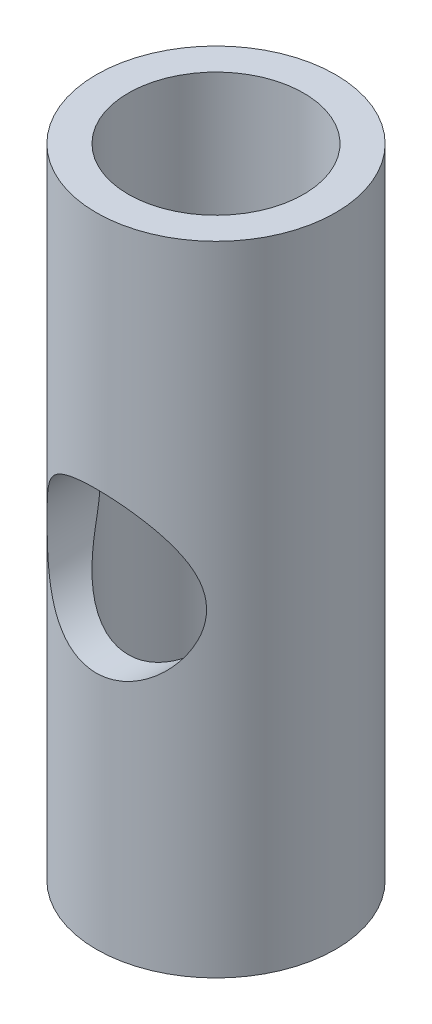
ISO-10303-21;
HEADER;
FILE_DESCRIPTION(('STEP AP214'),'2;1');
FILE_NAME('part.step','',(''),(''),'','','');
FILE_SCHEMA(('AUTOMOTIVE_DESIGN { 1 0 10303 214 1 1 1 1 }'));
ENDSEC;
DATA;
#1=APPLICATION_CONTEXT('core data for automotive mechanical design processes');
#2=APPLICATION_PROTOCOL_DEFINITION('international standard','automotive_design',2000,#1);
#3=PRODUCT_CONTEXT('',#1,'mechanical');
#4=PRODUCT('Part','Part','',(#3));
#5=PRODUCT_RELATED_PRODUCT_CATEGORY('part','',(#4));
#6=PRODUCT_DEFINITION_FORMATION('','',#4);
#7=PRODUCT_DEFINITION_CONTEXT('part definition',#1,'design');
#8=PRODUCT_DEFINITION('design','',#6,#7);
#9=PRODUCT_DEFINITION_SHAPE('','',#8);
#10=(LENGTH_UNIT() NAMED_UNIT(*) SI_UNIT(.MILLI.,.METRE.));
#11=(NAMED_UNIT(*) PLANE_ANGLE_UNIT() SI_UNIT($,.RADIAN.));
#12=(NAMED_UNIT(*) SI_UNIT($,.STERADIAN.) SOLID_ANGLE_UNIT());
#13=UNCERTAINTY_MEASURE_WITH_UNIT(LENGTH_MEASURE(1.E-05),#10,'distance_accuracy_value','');
#14=(GEOMETRIC_REPRESENTATION_CONTEXT(3) GLOBAL_UNCERTAINTY_ASSIGNED_CONTEXT((#13)) GLOBAL_UNIT_ASSIGNED_CONTEXT((#10,
#11,#12)) REPRESENTATION_CONTEXT('',''));
#15=CARTESIAN_POINT('',(0.,0.,0.));
#16=DIRECTION('',(0.,0.,1.));
#17=DIRECTION('',(1.,0.,0.));
#18=AXIS2_PLACEMENT_3D('',#15,#16,#17);
#19=CARTESIAN_POINT('',(0.,8.,0.));
#20=DIRECTION('',(0.,-1.,0.));
#21=DIRECTION('',(0.,0.,-1.));
#22=AXIS2_PLACEMENT_3D('',#19,#20,#21);
#23=CYLINDRICAL_SURFACE('',#22,1.5);
#24=CARTESIAN_POINT('',(0.,8.,0.));
#25=DIRECTION('',(0.,1.,0.));
#26=DIRECTION('',(0.,0.,1.));
#27=AXIS2_PLACEMENT_3D('',#24,#25,#26);
#28=CIRCLE('',#27,1.5);
#29=CARTESIAN_POINT('',(0.,8.,1.5));
#30=VERTEX_POINT('',#29);
#31=EDGE_CURVE('E10',#30,#30,#28,.T.);
#32=ORIENTED_EDGE('',*,*,#31,.F.);
#33=EDGE_LOOP('',(#32));
#34=FACE_BOUND('',#33,.T.);
#35=CARTESIAN_POINT('',(0.,0.,0.));
#36=DIRECTION('',(0.,1.,0.));
#37=DIRECTION('',(0.,0.,1.));
#38=AXIS2_PLACEMENT_3D('',#35,#36,#37);
#39=CIRCLE('',#38,1.5);
#40=CARTESIAN_POINT('',(0.,0.,1.5));
#41=VERTEX_POINT('',#40);
#42=EDGE_CURVE('E41',#41,#41,#39,.T.);
#43=ORIENTED_EDGE('',*,*,#42,.T.);
#44=EDGE_LOOP('',(#43));
#45=FACE_BOUND('',#44,.T.);
#46=CARTESIAN_POINT('',(0.,3.,1.5));
#47=CARTESIAN_POINT('',(0.050242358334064,2.99999972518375,1.50000020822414));
#48=CARTESIAN_POINT('',(0.100484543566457,3.00380698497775,1.49745401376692));
#49=CARTESIAN_POINT('',(0.199366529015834,3.01879843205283,1.48752326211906));
#50=CARTESIAN_POINT('',(0.248005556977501,3.02998612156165,1.48013640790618));
#51=CARTESIAN_POINT('',(0.342106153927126,3.05905385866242,1.46125241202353));
#52=CARTESIAN_POINT('',(0.387581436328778,3.07690257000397,1.44977452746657));
#53=CARTESIAN_POINT('',(0.474707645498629,3.11853168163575,1.4236306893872));
#54=CARTESIAN_POINT('',(0.516358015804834,3.14231294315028,1.40896427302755));
#55=CARTESIAN_POINT('',(0.598642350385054,3.19732846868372,1.37613664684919));
#56=CARTESIAN_POINT('',(0.638890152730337,3.22902393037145,1.3577844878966));
#57=CARTESIAN_POINT('',(0.713864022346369,3.29786502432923,1.31991156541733));
#58=CARTESIAN_POINT('',(0.748582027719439,3.33501846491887,1.30038915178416));
#59=CARTESIAN_POINT('',(0.81711148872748,3.42052618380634,1.25864132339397));
#60=CARTESIAN_POINT('',(0.849915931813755,3.46972282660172,1.23647533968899));
#61=CARTESIAN_POINT('',(0.906751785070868,3.57418168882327,1.19542073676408));
#62=CARTESIAN_POINT('',(0.930798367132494,3.62943320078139,1.17652647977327));
#63=CARTESIAN_POINT('',(0.963370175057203,3.7283556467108,1.14988133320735));
#64=CARTESIAN_POINT('',(0.974372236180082,3.77076422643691,1.14048813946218));
#65=CARTESIAN_POINT('',(0.9907530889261,3.85737225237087,1.12628984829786));
#66=CARTESIAN_POINT('',(0.996141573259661,3.90156847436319,1.12147684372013));
#67=CARTESIAN_POINT('',(1.00095682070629,3.99073738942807,1.11718302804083));
#68=CARTESIAN_POINT('',(1.0003592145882,4.0357125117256,1.11772401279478));
#69=CARTESIAN_POINT('',(0.993187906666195,4.12481748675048,1.12409887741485));
#70=CARTESIAN_POINT('',(0.986609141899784,4.16894659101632,1.12993724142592));
#71=CARTESIAN_POINT('',(0.968324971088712,4.25323352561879,1.14563592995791));
#72=CARTESIAN_POINT('',(0.956858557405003,4.29348066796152,1.15530744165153));
#73=CARTESIAN_POINT('',(0.929350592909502,4.37151184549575,1.17754811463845));
#74=CARTESIAN_POINT('',(0.913307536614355,4.40929506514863,1.19011822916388));
#75=CARTESIAN_POINT('',(0.873369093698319,4.48951269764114,1.21982098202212));
#76=CARTESIAN_POINT('',(0.848540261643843,4.53132995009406,1.23736158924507));
#77=CARTESIAN_POINT('',(0.79334480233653,4.6106916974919,1.27345768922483));
#78=CARTESIAN_POINT('',(0.762971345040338,4.64823082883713,1.29201441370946));
#79=CARTESIAN_POINT('',(0.689905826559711,4.72627127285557,1.33271671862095));
#80=CARTESIAN_POINT('',(0.645969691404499,4.7656670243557,1.35477372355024));
#81=CARTESIAN_POINT('',(0.551003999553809,4.83659824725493,1.39609050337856));
#82=CARTESIAN_POINT('',(0.499981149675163,4.86814107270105,1.41535288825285));
#83=CARTESIAN_POINT('',(0.4024289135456,4.9167388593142,1.44572702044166));
#84=CARTESIAN_POINT('',(0.356978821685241,4.93542168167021,1.45769630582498));
#85=CARTESIAN_POINT('',(0.263018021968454,4.96605246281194,1.47753859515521));
#86=CARTESIAN_POINT('',(0.214509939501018,4.97800611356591,1.48541506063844));
#87=CARTESIAN_POINT('',(0.115492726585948,4.9945805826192,1.49637941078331));
#88=CARTESIAN_POINT('',(0.0649759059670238,4.99916973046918,1.49944661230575));
#89=CARTESIAN_POINT('',(-0.0362207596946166,5.00062354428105,1.50041557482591));
#90=CARTESIAN_POINT('',(-0.0869005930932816,4.99748875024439,1.49831769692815));
#91=CARTESIAN_POINT('',(-0.183227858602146,4.98418797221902,1.48949794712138));
#92=CARTESIAN_POINT('',(-0.228978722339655,4.97453135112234,1.48311123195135));
#93=CARTESIAN_POINT('',(-0.31805819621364,4.94920215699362,1.46659224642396));
#94=CARTESIAN_POINT('',(-0.361386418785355,4.9335286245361,1.45645937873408));
#95=CARTESIAN_POINT('',(-0.447332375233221,4.89567385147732,1.4324817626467));
#96=CARTESIAN_POINT('',(-0.489748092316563,4.87315592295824,1.41844935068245));
#97=CARTESIAN_POINT('',(-0.570341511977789,4.8227833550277,1.38800927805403));
#98=CARTESIAN_POINT('',(-0.608516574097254,4.79492541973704,1.37160015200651));
#99=CARTESIAN_POINT('',(-0.685927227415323,4.72969606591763,1.33477273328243));
#100=CARTESIAN_POINT('',(-0.724375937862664,4.69151686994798,1.31413078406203));
#101=CARTESIAN_POINT('',(-0.794669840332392,4.60944428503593,1.27285586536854));
#102=CARTESIAN_POINT('',(-0.826510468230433,4.5655469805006,1.25222291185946));
#103=CARTESIAN_POINT('',(-0.880623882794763,4.4764287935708,1.21469839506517));
#104=CARTESIAN_POINT('',(-0.903478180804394,4.43163398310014,1.19763798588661));
#105=CARTESIAN_POINT('',(-0.942481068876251,4.33806367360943,1.16719487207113));
#106=CARTESIAN_POINT('',(-0.958641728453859,4.2892955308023,1.1538055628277));
#107=CARTESIAN_POINT('',(-0.981179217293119,4.19771775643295,1.13466604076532));
#108=CARTESIAN_POINT('',(-0.988792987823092,4.15541409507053,1.12797499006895));
#109=CARTESIAN_POINT('',(-0.998496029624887,4.06971335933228,1.11939733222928));
#110=CARTESIAN_POINT('',(-1.00059130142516,4.02631752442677,1.11750550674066));
#111=CARTESIAN_POINT('',(-0.999119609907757,3.93967847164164,1.11882100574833));
#112=CARTESIAN_POINT('',(-0.995549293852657,3.89643535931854,1.12203134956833));
#113=CARTESIAN_POINT('',(-0.982984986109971,3.81132823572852,1.1330522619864));
#114=CARTESIAN_POINT('',(-0.97398375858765,3.76946614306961,1.14086896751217));
#115=CARTESIAN_POINT('',(-0.947965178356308,3.67714440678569,1.1626342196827));
#116=CARTESIAN_POINT('',(-0.929450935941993,3.62736614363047,1.17766166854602));
#117=CARTESIAN_POINT('',(-0.885422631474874,3.53225658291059,1.21111080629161));
#118=CARTESIAN_POINT('',(-0.859898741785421,3.48693165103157,1.22953724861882));
#119=CARTESIAN_POINT('',(-0.801991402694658,3.40035905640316,1.26808593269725));
#120=CARTESIAN_POINT('',(-0.769491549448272,3.35920062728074,1.2882329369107));
#121=CARTESIAN_POINT('',(-0.698358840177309,3.28233876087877,1.32814150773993));
#122=CARTESIAN_POINT('',(-0.659724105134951,3.24663700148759,1.3479029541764));
#123=CARTESIAN_POINT('',(-0.570728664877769,3.17664394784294,1.38815775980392));
#124=CARTESIAN_POINT('',(-0.519480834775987,3.14329067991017,1.40834902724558));
#125=CARTESIAN_POINT('',(-0.41043427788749,3.08604336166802,1.44388832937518));
#126=CARTESIAN_POINT('',(-0.352646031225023,3.06213444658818,1.45924396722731));
#127=CARTESIAN_POINT('',(-0.245717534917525,3.02942271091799,1.48050822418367));
#128=CARTESIAN_POINT('',(-0.197506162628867,3.01844448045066,1.48775740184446));
#129=CARTESIAN_POINT('',(-0.099529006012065,3.00373598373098,1.49750140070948));
#130=CARTESIAN_POINT('',(-0.0497644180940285,3.000000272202,1.49999979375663));
#131=CARTESIAN_POINT('',(0.,3.,1.5));
#132=B_SPLINE_CURVE_WITH_KNOTS('',3,(#46,#47,#48,#49,#50,#51,#52,#53,#54,#55,#56,#57,#58,#59,
#60,#61,#62,#63,#64,#65,#66,#67,#68,#69,#70,#71,#72,#73,#74,#75,#76,#77,#78,#79,#80,#81,#82,#83,
#84,#85,#86,#87,#88,#89,#90,#91,#92,#93,#94,#95,#96,#97,#98,#99,#100,#101,#102,#103,#104,#105,
#106,#107,#108,#109,#110,#111,#112,#113,#114,#115,#116,#117,#118,#119,#120,#121,#122,#123,#124,
#125,#126,#127,#128,#129,#130,#131),.UNSPECIFIED.,.T.,.F.,(4,2,2,2,2,2,2,2,2,2,2,2,2,2,2,2,2,2,
2,2,2,2,2,2,2,2,2,2,2,2,2,2,2,2,2,2,2,2,2,2,2,2,4),(0.,0.1505266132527,0.301124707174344,
0.451023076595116,0.600943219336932,0.763585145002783,0.926462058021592,1.11503341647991,
1.30327652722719,1.43716846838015,1.57082883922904,1.70503355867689,1.83935198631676,
1.96774431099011,2.09617891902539,2.25073787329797,2.40548851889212,2.5935947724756,
2.78152420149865,2.93262043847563,3.08358867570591,3.23520441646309,3.38680955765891,
3.5277654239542,3.66874377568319,3.81826173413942,3.96787227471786,4.1411408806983,
4.31452876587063,4.473249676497,4.63168313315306,4.76162024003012,4.8914160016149,
5.02128860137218,5.15133461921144,5.31603304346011,5.48096356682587,5.64889622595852,
5.81688041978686,6.00897675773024,6.20076953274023,6.34997645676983,6.49907115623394),.UNSPECIFIED.);
#133=CARTESIAN_POINT('',(0.,3.,1.5));
#134=VERTEX_POINT('',#133);
#135=EDGE_CURVE('E53',#134,#134,#132,.T.);
#136=ORIENTED_EDGE('',*,*,#135,.F.);
#137=EDGE_LOOP('',(#136));
#138=FACE_BOUND('',#137,.T.);
#139=ADVANCED_FACE('F29',(#34,#45,#138),#23,.T.);
#140=CARTESIAN_POINT('',(0.,8.,0.));
#141=DIRECTION('',(0.,-1.,0.));
#142=DIRECTION('',(0.,0.,-1.));
#143=AXIS2_PLACEMENT_3D('',#140,#141,#142);
#144=CYLINDRICAL_SURFACE('',#143,1.1);
#145=CARTESIAN_POINT('',(0.,0.,0.));
#146=DIRECTION('',(0.,1.,0.));
#147=DIRECTION('',(0.,0.,1.));
#148=AXIS2_PLACEMENT_3D('',#145,#146,#147);
#149=CIRCLE('',#148,1.1);
#150=CARTESIAN_POINT('',(0.,0.,1.1));
#151=VERTEX_POINT('',#150);
#152=EDGE_CURVE('E50',#151,#151,#149,.T.);
#153=ORIENTED_EDGE('',*,*,#152,.F.);
#154=EDGE_LOOP('',(#153));
#155=FACE_BOUND('',#154,.T.);
#156=CARTESIAN_POINT('',(0.,8.,0.));
#157=DIRECTION('',(0.,1.,0.));
#158=DIRECTION('',(0.,0.,1.));
#159=AXIS2_PLACEMENT_3D('',#156,#157,#158);
#160=CIRCLE('',#159,1.1);
#161=CARTESIAN_POINT('',(0.,8.,1.1));
#162=VERTEX_POINT('',#161);
#163=EDGE_CURVE('E45',#162,#162,#160,.T.);
#164=ORIENTED_EDGE('',*,*,#163,.T.);
#165=EDGE_LOOP('',(#164));
#166=FACE_BOUND('',#165,.T.);
#167=CARTESIAN_POINT('',(-1.,4.,0.458257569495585));
#168=CARTESIAN_POINT('',(-0.999997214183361,3.97089089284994,0.458267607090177));
#169=CARTESIAN_POINT('',(-0.998709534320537,3.94175559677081,0.461104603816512));
#170=CARTESIAN_POINT('',(-0.993736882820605,3.88458571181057,0.471717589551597));
#171=CARTESIAN_POINT('',(-0.990042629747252,3.85655583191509,0.479512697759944));
#172=CARTESIAN_POINT('',(-0.978267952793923,3.7885564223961,0.503226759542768));
#173=CARTESIAN_POINT('',(-0.96892004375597,3.74957812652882,0.521257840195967));
#174=CARTESIAN_POINT('',(-0.94643334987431,3.67472973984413,0.561064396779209));
#175=CARTESIAN_POINT('',(-0.933279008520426,3.63887320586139,0.582855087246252));
#176=CARTESIAN_POINT('',(-0.905239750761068,3.57380875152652,0.625390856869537));
#177=CARTESIAN_POINT('',(-0.890740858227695,3.54431505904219,0.645957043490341));
#178=CARTESIAN_POINT('',(-0.859074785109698,3.48710597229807,0.687514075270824));
#179=CARTESIAN_POINT('',(-0.841905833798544,3.45939177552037,0.708505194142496));
#180=CARTESIAN_POINT('',(-0.786413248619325,3.37886841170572,0.771136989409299));
#181=CARTESIAN_POINT('',(-0.744040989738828,3.32853348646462,0.81253803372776));
#182=CARTESIAN_POINT('',(-0.660058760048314,3.2471135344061,0.881194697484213));
#183=CARTESIAN_POINT('',(-0.620853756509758,3.21434694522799,0.909415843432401));
#184=CARTESIAN_POINT('',(-0.536082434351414,3.15424302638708,0.961813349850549));
#185=CARTESIAN_POINT('',(-0.490527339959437,3.12689631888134,0.985996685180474));
#186=CARTESIAN_POINT('',(-0.403126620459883,3.0838304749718,1.02434980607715));
#187=CARTESIAN_POINT('',(-0.362345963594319,3.06688045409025,1.0395545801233));
#188=CARTESIAN_POINT('',(-0.277567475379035,3.03825522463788,1.06532327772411));
#189=CARTESIAN_POINT('',(-0.233571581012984,3.02657687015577,1.0758899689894));
#190=CARTESIAN_POINT('',(-0.143150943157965,3.00922349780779,1.09161555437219));
#191=CARTESIAN_POINT('',(-0.096712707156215,3.00358655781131,1.09674014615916));
#192=CARTESIAN_POINT('',(-0.00323463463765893,2.99891237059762,1.1009883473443));
#193=CARTESIAN_POINT('',(0.043804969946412,2.99987265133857,1.10011420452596));
#194=CARTESIAN_POINT('',(0.132037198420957,3.00786703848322,1.09285206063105));
#195=CARTESIAN_POINT('',(0.17333762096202,3.01427297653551,1.08703433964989));
#196=CARTESIAN_POINT('',(0.254008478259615,3.03191656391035,1.07106095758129));
#197=CARTESIAN_POINT('',(0.293378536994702,3.04315515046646,1.06090445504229));
#198=CARTESIAN_POINT('',(0.371324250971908,3.07053247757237,1.03627800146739));
#199=CARTESIAN_POINT('',(0.409762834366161,3.08688727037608,1.02161851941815));
#200=CARTESIAN_POINT('',(0.483189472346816,3.12352166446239,0.989012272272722));
#201=CARTESIAN_POINT('',(0.518176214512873,3.14380274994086,0.971064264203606));
#202=CARTESIAN_POINT('',(0.601984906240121,3.1991885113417,0.92251529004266));
#203=CARTESIAN_POINT('',(0.648394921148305,3.23647647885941,0.890227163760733));
#204=CARTESIAN_POINT('',(0.732817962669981,3.31706194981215,0.82215453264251));
#205=CARTESIAN_POINT('',(0.77080047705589,3.36038039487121,0.786357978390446));
#206=CARTESIAN_POINT('',(0.839400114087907,3.4533411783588,0.712726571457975));
#207=CARTESIAN_POINT('',(0.869812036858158,3.50311333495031,0.674863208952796));
#208=CARTESIAN_POINT('',(0.908958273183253,3.58208848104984,0.61992347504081));
#209=CARTESIAN_POINT('',(0.920918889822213,3.60910124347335,0.601938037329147));
#210=CARTESIAN_POINT('',(0.942628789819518,3.66482021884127,0.567330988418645));
#211=CARTESIAN_POINT('',(0.952380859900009,3.69352423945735,0.550707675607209));
#212=CARTESIAN_POINT('',(0.968189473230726,3.74841478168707,0.522333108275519));
#213=CARTESIAN_POINT('',(0.974582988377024,3.77431592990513,0.510225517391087));
#214=CARTESIAN_POINT('',(0.985416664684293,3.82768736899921,0.488974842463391));
#215=CARTESIAN_POINT('',(0.989861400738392,3.85515381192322,0.479824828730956));
#216=CARTESIAN_POINT('',(0.995949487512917,3.90698871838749,0.467041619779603));
#217=CARTESIAN_POINT('',(0.997926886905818,3.93115131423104,0.462760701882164));
#218=CARTESIAN_POINT('',(1.00009509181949,3.97992074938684,0.45805859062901));
#219=CARTESIAN_POINT('',(1.00028824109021,4.00452696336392,0.457632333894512));
#220=CARTESIAN_POINT('',(0.998873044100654,4.05338809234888,0.460710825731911));
#221=CARTESIAN_POINT('',(0.997267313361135,4.0776434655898,0.464209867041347));
#222=CARTESIAN_POINT('',(0.992411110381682,4.12528454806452,0.474501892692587));
#223=CARTESIAN_POINT('',(0.98915731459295,4.14866839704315,0.48130153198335));
#224=CARTESIAN_POINT('',(0.978191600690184,4.21168187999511,0.503370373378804));
#225=CARTESIAN_POINT('',(0.968971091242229,4.25014432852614,0.521148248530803));
#226=CARTESIAN_POINT('',(0.946829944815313,4.32405638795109,0.560381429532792));
#227=CARTESIAN_POINT('',(0.933891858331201,4.35949074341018,0.581853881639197));
#228=CARTESIAN_POINT('',(0.906186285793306,4.42417340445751,0.624015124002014));
#229=CARTESIAN_POINT('',(0.8917638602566,4.45367756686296,0.644540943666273));
#230=CARTESIAN_POINT('',(0.860256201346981,4.51090820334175,0.686032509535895));
#231=CARTESIAN_POINT('',(0.843169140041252,4.53863343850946,0.706998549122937));
#232=CARTESIAN_POINT('',(0.787930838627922,4.61919777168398,0.769576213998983));
#233=CARTESIAN_POINT('',(0.745741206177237,4.66956754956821,0.81096702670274));
#234=CARTESIAN_POINT('',(0.661974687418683,4.75120925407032,0.879759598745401));
#235=CARTESIAN_POINT('',(0.622774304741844,4.78413832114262,0.908106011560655));
#236=CARTESIAN_POINT('',(0.537979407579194,4.8445577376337,0.96075751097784));
#237=CARTESIAN_POINT('',(0.49239639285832,4.87205765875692,0.985069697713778));
#238=CARTESIAN_POINT('',(0.404964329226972,4.91535989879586,1.02362535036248));
#239=CARTESIAN_POINT('',(0.36419268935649,4.9324017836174,1.03891009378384));
#240=CARTESIAN_POINT('',(0.279412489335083,4.9612117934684,1.06484188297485));
#241=CARTESIAN_POINT('',(0.235405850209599,4.97298301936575,1.07549165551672));
#242=CARTESIAN_POINT('',(0.144938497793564,4.99051850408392,1.09138125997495));
#243=CARTESIAN_POINT('',(0.098464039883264,4.99624435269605,1.09658649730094));
#244=CARTESIAN_POINT('',(0.00489180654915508,5.00108325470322,1.10098433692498));
#245=CARTESIAN_POINT('',(-0.0422057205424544,5.00019886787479,1.10017926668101));
#246=CARTESIAN_POINT('',(-0.130525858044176,4.99233364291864,1.09303428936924));
#247=CARTESIAN_POINT('',(-0.171855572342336,4.98598740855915,1.08727054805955));
#248=CARTESIAN_POINT('',(-0.252594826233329,4.96845416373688,1.07139613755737));
#249=CARTESIAN_POINT('',(-0.292003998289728,4.95726623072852,1.06128463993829));
#250=CARTESIAN_POINT('',(-0.369993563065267,4.92999718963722,1.03675328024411));
#251=CARTESIAN_POINT('',(-0.408440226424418,4.91370439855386,1.02214765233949));
#252=CARTESIAN_POINT('',(-0.481892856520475,4.87719118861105,0.98964433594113));
#253=CARTESIAN_POINT('',(-0.516897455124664,4.85696921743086,0.97174534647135));
#254=CARTESIAN_POINT('',(-0.600729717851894,4.80174913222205,0.923330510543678));
#255=CARTESIAN_POINT('',(-0.64715476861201,4.76457048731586,0.891127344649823));
#256=CARTESIAN_POINT('',(-0.731622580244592,4.68421283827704,0.823216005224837));
#257=CARTESIAN_POINT('',(-0.769636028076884,4.64101368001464,0.787496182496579));
#258=CARTESIAN_POINT('',(-0.838309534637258,4.54831951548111,0.714006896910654));
#259=CARTESIAN_POINT('',(-0.86876722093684,4.4986964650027,0.676208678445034));
#260=CARTESIAN_POINT('',(-0.908014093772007,4.41995619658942,0.621306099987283));
#261=CARTESIAN_POINT('',(-0.920016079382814,4.39301507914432,0.603318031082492));
#262=CARTESIAN_POINT('',(-0.941816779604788,4.33744943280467,0.568679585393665));
#263=CARTESIAN_POINT('',(-0.951618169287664,4.30882700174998,0.552027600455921));
#264=CARTESIAN_POINT('',(-0.967993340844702,4.25251146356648,0.522725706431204));
#265=CARTESIAN_POINT('',(-0.974790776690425,4.22500756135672,0.509842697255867));
#266=CARTESIAN_POINT('',(-0.986166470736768,4.1682439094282,0.487477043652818));
#267=CARTESIAN_POINT('',(-0.990753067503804,4.13899123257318,0.4779816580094));
#268=CARTESIAN_POINT('',(-0.995993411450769,4.09120176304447,0.466924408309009));
#269=CARTESIAN_POINT('',(-0.997487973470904,4.07314345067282,0.463706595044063));
#270=CARTESIAN_POINT('',(-0.99949187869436,4.03672678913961,0.459370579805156));
#271=CARTESIAN_POINT('',(-1.00000175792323,4.01836860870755,0.458251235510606));
#272=CARTESIAN_POINT('',(-1.,4.,0.458257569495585));
#273=B_SPLINE_CURVE_WITH_KNOTS('',3,(#167,#168,#169,#170,#171,#172,#173,#174,#175,#176,#177,
#178,#179,#180,#181,#182,#183,#184,#185,#186,#187,#188,#189,#190,#191,#192,#193,#194,#195,#196,
#197,#198,#199,#200,#201,#202,#203,#204,#205,#206,#207,#208,#209,#210,#211,#212,#213,#214,#215,
#216,#217,#218,#219,#220,#221,#222,#223,#224,#225,#226,#227,#228,#229,#230,#231,#232,#233,#234,
#235,#236,#237,#238,#239,#240,#241,#242,#243,#244,#245,#246,#247,#248,#249,#250,#251,#252,#253,
#254,#255,#256,#257,#258,#259,#260,#261,#262,#263,#264,#265,#266,#267,#268,#269,#270,#271,#272),
.UNSPECIFIED.,.T.,.F.,(4,2,2,2,2,2,2,2,2,2,2,2,2,2,2,2,2,2,2,2,2,2,2,2,2,2,2,2,2,2,2,2,2,2,2,2,
2,2,2,2,2,2,2,2,2,2,2,2,2,2,2,2,4),(0.,0.0872368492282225,0.174812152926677,0.305921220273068,
0.437573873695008,0.553728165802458,0.669959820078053,0.901865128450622,1.07639604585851,
1.25062228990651,1.39018808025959,1.52967047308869,1.67002691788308,1.81033077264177,
1.93635390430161,2.06240148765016,2.19472279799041,2.32709422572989,2.52914636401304,
2.73191852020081,2.9397013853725,3.04336717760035,3.14690142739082,3.23461778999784,
3.32212711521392,3.39565953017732,3.46909534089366,3.54242451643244,3.61590216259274,
3.74525125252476,3.87521768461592,3.99124419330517,4.10735064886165,4.33901754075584,
4.51399313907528,4.68865744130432,4.82837826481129,4.96801677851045,5.10853726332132,
5.24900333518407,5.375062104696,5.50114490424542,5.63336527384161,5.76563798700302,
5.96742061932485,6.16989572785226,6.37731822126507,6.48086403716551,6.58428329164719,
6.67744921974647,6.77026095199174,6.8253396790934,6.88038841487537),.UNSPECIFIED.);
#274=CARTESIAN_POINT('',(-1.,4.,0.458257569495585));
#275=VERTEX_POINT('',#274);
#276=EDGE_CURVE('E33',#275,#275,#273,.T.);
#277=ORIENTED_EDGE('',*,*,#276,.T.);
#278=EDGE_LOOP('',(#277));
#279=FACE_BOUND('',#278,.T.);
#280=ADVANCED_FACE('F62',(#155,#166,#279),#144,.F.);
#281=CARTESIAN_POINT('',(0.,8.,0.));
#282=DIRECTION('',(0.,1.,0.));
#283=DIRECTION('',(0.,0.,1.));
#284=AXIS2_PLACEMENT_3D('',#281,#282,#283);
#285=PLANE('',#284);
#286=ORIENTED_EDGE('',*,*,#31,.T.);
#287=EDGE_LOOP('',(#286));
#288=FACE_BOUND('',#287,.T.);
#289=ORIENTED_EDGE('',*,*,#163,.F.);
#290=EDGE_LOOP('',(#289));
#291=FACE_BOUND('',#290,.T.);
#292=ADVANCED_FACE('F67',(#288,#291),#285,.T.);
#293=CARTESIAN_POINT('',(0.,0.,0.));
#294=DIRECTION('',(0.,1.,0.));
#295=DIRECTION('',(0.,0.,1.));
#296=AXIS2_PLACEMENT_3D('',#293,#294,#295);
#297=PLANE('',#296);
#298=ORIENTED_EDGE('',*,*,#42,.F.);
#299=EDGE_LOOP('',(#298));
#300=FACE_BOUND('',#299,.T.);
#301=ORIENTED_EDGE('',*,*,#152,.T.);
#302=EDGE_LOOP('',(#301));
#303=FACE_BOUND('',#302,.T.);
#304=ADVANCED_FACE('F60',(#300,#303),#297,.F.);
#305=CARTESIAN_POINT('',(0.,4.,1.5));
#306=DIRECTION('',(0.,0.,-1.));
#307=DIRECTION('',(-1.,0.,0.));
#308=AXIS2_PLACEMENT_3D('',#305,#306,#307);
#309=CYLINDRICAL_SURFACE('',#308,1.);
#310=ORIENTED_EDGE('',*,*,#276,.F.);
#311=EDGE_LOOP('',(#310));
#312=FACE_BOUND('',#311,.T.);
#313=ORIENTED_EDGE('',*,*,#135,.T.);
#314=EDGE_LOOP('',(#313));
#315=FACE_BOUND('',#314,.T.);
#316=ADVANCED_FACE('F57',(#312,#315),#309,.F.);
#317=CLOSED_SHELL('',(#139,#280,#292,#304,#316));
#318=MANIFOLD_SOLID_BREP('B2',#317);
#319=ADVANCED_BREP_SHAPE_REPRESENTATION('',(#18,#318),#14);
#320=SHAPE_DEFINITION_REPRESENTATION(#9,#319);
ENDSEC;
END-ISO-10303-21;
